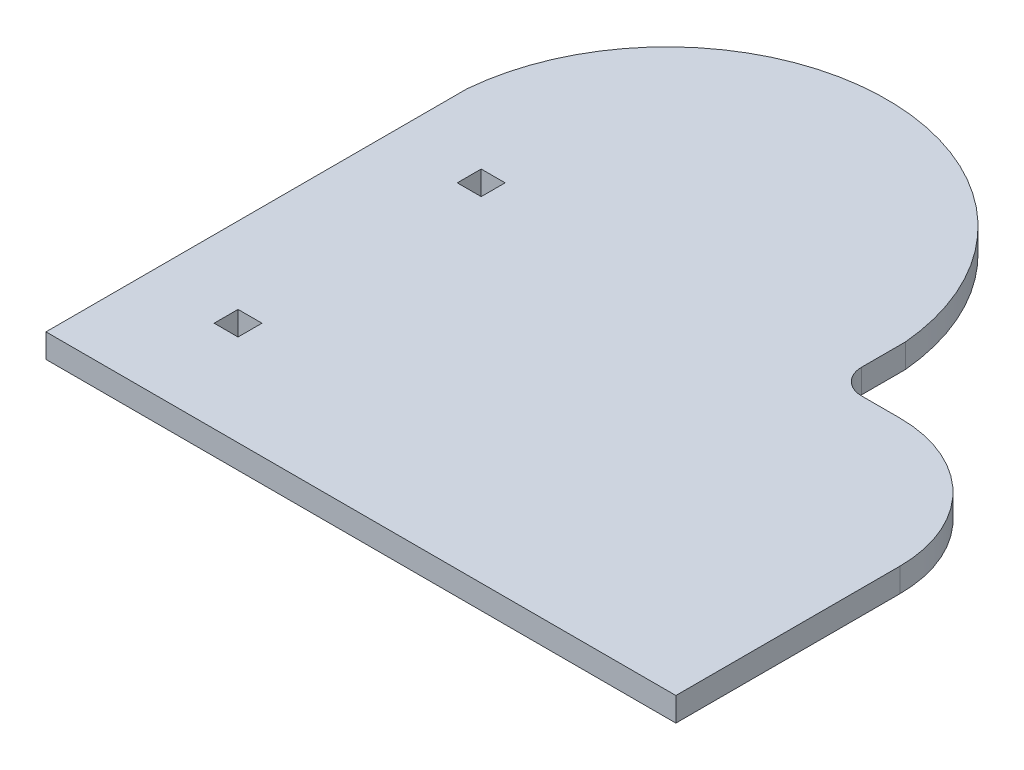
ISO-10303-21;
HEADER;
FILE_DESCRIPTION(('STEP AP214'),'2;1');
FILE_NAME('part.step','',(''),(''),'','','');
FILE_SCHEMA(('AUTOMOTIVE_DESIGN { 1 0 10303 214 1 1 1 1 }'));
ENDSEC;
DATA;
#1=APPLICATION_CONTEXT('core data for automotive mechanical design processes');
#2=APPLICATION_PROTOCOL_DEFINITION('international standard','automotive_design',2000,#1);
#3=PRODUCT_CONTEXT('',#1,'mechanical');
#4=PRODUCT('Part','Part','',(#3));
#5=PRODUCT_RELATED_PRODUCT_CATEGORY('part','',(#4));
#6=PRODUCT_DEFINITION_FORMATION('','',#4);
#7=PRODUCT_DEFINITION_CONTEXT('part definition',#1,'design');
#8=PRODUCT_DEFINITION('design','',#6,#7);
#9=PRODUCT_DEFINITION_SHAPE('','',#8);
#10=(LENGTH_UNIT() NAMED_UNIT(*) SI_UNIT(.MILLI.,.METRE.));
#11=(NAMED_UNIT(*) PLANE_ANGLE_UNIT() SI_UNIT($,.RADIAN.));
#12=(NAMED_UNIT(*) SI_UNIT($,.STERADIAN.) SOLID_ANGLE_UNIT());
#13=UNCERTAINTY_MEASURE_WITH_UNIT(LENGTH_MEASURE(1.E-05),#10,'distance_accuracy_value','');
#14=(GEOMETRIC_REPRESENTATION_CONTEXT(3) GLOBAL_UNCERTAINTY_ASSIGNED_CONTEXT((#13)) GLOBAL_UNIT_ASSIGNED_CONTEXT((#10,
#11,#12)) REPRESENTATION_CONTEXT('',''));
#15=CARTESIAN_POINT('',(0.,0.,0.));
#16=DIRECTION('',(0.,0.,1.));
#17=DIRECTION('',(1.,0.,0.));
#18=AXIS2_PLACEMENT_3D('',#15,#16,#17);
#19=CARTESIAN_POINT('',(6.85799999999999,3.175,0.));
#20=DIRECTION('',(1.,0.,0.));
#21=DIRECTION('',(0.,0.,-1.));
#22=AXIS2_PLACEMENT_3D('',#19,#20,#21);
#23=PLANE('',#22);
#24=DIRECTION('',(0.,0.,1.));
#25=VECTOR('',#24,1.);
#26=CARTESIAN_POINT('',(6.85799999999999,0.,0.));
#27=LINE('',#26,#25);
#28=CARTESIAN_POINT('',(6.858,0.,10.16));
#29=VERTEX_POINT('',#28);
#30=CARTESIAN_POINT('',(6.858,0.,39.878));
#31=VERTEX_POINT('',#30);
#32=EDGE_CURVE('E226',#29,#31,#27,.T.);
#33=ORIENTED_EDGE('',*,*,#32,.F.);
#34=DIRECTION('',(0.,-1.,0.));
#35=VECTOR('',#34,1.);
#36=CARTESIAN_POINT('',(6.858,3.175,10.16));
#37=LINE('',#36,#35);
#38=CARTESIAN_POINT('',(6.858,3.175,10.16));
#39=VERTEX_POINT('',#38);
#40=EDGE_CURVE('E230',#39,#29,#37,.T.);
#41=ORIENTED_EDGE('',*,*,#40,.F.);
#42=DIRECTION('',(0.,0.,1.));
#43=VECTOR('',#42,1.);
#44=CARTESIAN_POINT('',(6.85799999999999,3.175,0.));
#45=LINE('',#44,#43);
#46=CARTESIAN_POINT('',(6.858,3.175,39.878));
#47=VERTEX_POINT('',#46);
#48=EDGE_CURVE('E218',#39,#47,#45,.T.);
#49=ORIENTED_EDGE('',*,*,#48,.T.);
#50=DIRECTION('',(0.,-1.,0.));
#51=VECTOR('',#50,1.);
#52=CARTESIAN_POINT('',(6.858,3.175,39.878));
#53=LINE('',#52,#51);
#54=EDGE_CURVE('E42',#47,#31,#53,.T.);
#55=ORIENTED_EDGE('',*,*,#54,.T.);
#56=EDGE_LOOP('',(#33,#41,#49,#55));
#57=FACE_BOUND('',#56,.T.);
#58=ADVANCED_FACE('F33',(#57),#23,.T.);
#59=CARTESIAN_POINT('',(-76.708,3.175,0.));
#60=DIRECTION('',(1.,0.,0.));
#61=DIRECTION('',(0.,0.,-1.));
#62=AXIS2_PLACEMENT_3D('',#59,#60,#61);
#63=PLANE('',#62);
#64=DIRECTION('',(0.,0.,1.));
#65=VECTOR('',#64,1.);
#66=CARTESIAN_POINT('',(-76.708,0.,0.));
#67=LINE('',#66,#65);
#68=CARTESIAN_POINT('',(-76.708,0.,-15.9537511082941));
#69=VERTEX_POINT('',#68);
#70=CARTESIAN_POINT('',(-76.708,0.,39.878));
#71=VERTEX_POINT('',#70);
#72=EDGE_CURVE('E229',#69,#71,#67,.T.);
#73=ORIENTED_EDGE('',*,*,#72,.T.);
#74=DIRECTION('',(0.,-1.,0.));
#75=VECTOR('',#74,1.);
#76=CARTESIAN_POINT('',(-76.708,3.175,39.878));
#77=LINE('',#76,#75);
#78=CARTESIAN_POINT('',(-76.708,3.175,39.878));
#79=VERTEX_POINT('',#78);
#80=EDGE_CURVE('E11',#79,#71,#77,.T.);
#81=ORIENTED_EDGE('',*,*,#80,.F.);
#82=DIRECTION('',(0.,0.,1.));
#83=VECTOR('',#82,1.);
#84=CARTESIAN_POINT('',(-76.708,3.175,0.));
#85=LINE('',#84,#83);
#86=CARTESIAN_POINT('',(-76.708,3.175,-15.9537511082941));
#87=VERTEX_POINT('',#86);
#88=EDGE_CURVE('E221',#87,#79,#85,.T.);
#89=ORIENTED_EDGE('',*,*,#88,.F.);
#90=DIRECTION('',(0.,-1.,0.));
#91=VECTOR('',#90,1.);
#92=CARTESIAN_POINT('',(-76.708,3.175,-15.9537511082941));
#93=LINE('',#92,#91);
#94=EDGE_CURVE('E37',#87,#69,#93,.T.);
#95=ORIENTED_EDGE('',*,*,#94,.T.);
#96=EDGE_LOOP('',(#73,#81,#89,#95));
#97=FACE_BOUND('',#96,.T.);
#98=ADVANCED_FACE('F275',(#97),#63,.F.);
#99=CARTESIAN_POINT('',(0.,3.175,39.878));
#100=DIRECTION('',(0.,0.,-1.));
#101=DIRECTION('',(-1.,0.,0.));
#102=AXIS2_PLACEMENT_3D('',#99,#100,#101);
#103=PLANE('',#102);
#104=DIRECTION('',(1.,0.,0.));
#105=VECTOR('',#104,1.);
#106=CARTESIAN_POINT('',(0.,0.,39.878));
#107=LINE('',#106,#105);
#108=EDGE_CURVE('E222',#71,#31,#107,.T.);
#109=ORIENTED_EDGE('',*,*,#108,.T.);
#110=ORIENTED_EDGE('',*,*,#54,.F.);
#111=DIRECTION('',(1.,0.,0.));
#112=VECTOR('',#111,1.);
#113=CARTESIAN_POINT('',(0.,3.175,39.878));
#114=LINE('',#113,#112);
#115=EDGE_CURVE('E224',#79,#47,#114,.T.);
#116=ORIENTED_EDGE('',*,*,#115,.F.);
#117=ORIENTED_EDGE('',*,*,#80,.T.);
#118=EDGE_LOOP('',(#109,#110,#116,#117));
#119=FACE_BOUND('',#118,.T.);
#120=ADVANCED_FACE('F302',(#119),#103,.F.);
#121=CARTESIAN_POINT('',(0.,3.175,0.));
#122=DIRECTION('',(0.,1.,0.));
#123=DIRECTION('',(0.,0.,1.));
#124=AXIS2_PLACEMENT_3D('',#121,#122,#123);
#125=PLANE('',#124);
#126=DIRECTION('',(0.,0.,1.));
#127=VECTOR('',#126,1.);
#128=CARTESIAN_POINT('',(-66.548,3.175,-7.69875110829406));
#129=LINE('',#128,#127);
#130=CARTESIAN_POINT('',(-66.548,3.175,-7.69875110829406));
#131=VERTEX_POINT('',#130);
#132=CARTESIAN_POINT('',(-66.548,3.175,-4.52375110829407));
#133=VERTEX_POINT('',#132);
#134=EDGE_CURVE('E50',#131,#133,#129,.T.);
#135=ORIENTED_EDGE('',*,*,#134,.F.);
#136=DIRECTION('',(-1.,0.,0.));
#137=VECTOR('',#136,1.);
#138=CARTESIAN_POINT('',(-66.548,3.175,-7.69875110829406));
#139=LINE('',#138,#137);
#140=CARTESIAN_POINT('',(-63.373,3.175,-7.69875110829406));
#141=VERTEX_POINT('',#140);
#142=EDGE_CURVE('E169',#141,#131,#139,.T.);
#143=ORIENTED_EDGE('',*,*,#142,.F.);
#144=DIRECTION('',(0.,0.,-1.));
#145=VECTOR('',#144,1.);
#146=CARTESIAN_POINT('',(-63.373,3.175,-7.69875110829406));
#147=LINE('',#146,#145);
#148=CARTESIAN_POINT('',(-63.373,3.175,-4.52375110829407));
#149=VERTEX_POINT('',#148);
#150=EDGE_CURVE('E172',#149,#141,#147,.T.);
#151=ORIENTED_EDGE('',*,*,#150,.F.);
#152=DIRECTION('',(1.,0.,0.));
#153=VECTOR('',#152,1.);
#154=CARTESIAN_POINT('',(-66.548,3.175,-4.52375110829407));
#155=LINE('',#154,#153);
#156=EDGE_CURVE('E178',#133,#149,#155,.T.);
#157=ORIENTED_EDGE('',*,*,#156,.F.);
#158=EDGE_LOOP('',(#135,#143,#151,#157));
#159=FACE_BOUND('',#158,.T.);
#160=DIRECTION('',(0.,0.,1.));
#161=VECTOR('',#160,1.);
#162=CARTESIAN_POINT('',(-66.548,3.175,24.5592488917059));
#163=LINE('',#162,#161);
#164=CARTESIAN_POINT('',(-66.548,3.175,24.5592488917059));
#165=VERTEX_POINT('',#164);
#166=CARTESIAN_POINT('',(-66.548,3.175,27.7342488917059));
#167=VERTEX_POINT('',#166);
#168=EDGE_CURVE('E58',#165,#167,#163,.T.);
#169=ORIENTED_EDGE('',*,*,#168,.F.);
#170=DIRECTION('',(-1.,0.,0.));
#171=VECTOR('',#170,1.);
#172=CARTESIAN_POINT('',(-66.548,3.175,24.5592488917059));
#173=LINE('',#172,#171);
#174=CARTESIAN_POINT('',(-63.373,3.175,24.5592488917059));
#175=VERTEX_POINT('',#174);
#176=EDGE_CURVE('E193',#175,#165,#173,.T.);
#177=ORIENTED_EDGE('',*,*,#176,.F.);
#178=DIRECTION('',(0.,0.,-1.));
#179=VECTOR('',#178,1.);
#180=CARTESIAN_POINT('',(-63.373,3.175,24.5592488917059));
#181=LINE('',#180,#179);
#182=CARTESIAN_POINT('',(-63.373,3.175,27.7342488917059));
#183=VERTEX_POINT('',#182);
#184=EDGE_CURVE('E207',#183,#175,#181,.T.);
#185=ORIENTED_EDGE('',*,*,#184,.F.);
#186=DIRECTION('',(1.,0.,0.));
#187=VECTOR('',#186,1.);
#188=CARTESIAN_POINT('',(-66.548,3.175,27.7342488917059));
#189=LINE('',#188,#187);
#190=EDGE_CURVE('E204',#167,#183,#189,.T.);
#191=ORIENTED_EDGE('',*,*,#190,.F.);
#192=EDGE_LOOP('',(#169,#177,#185,#191));
#193=FACE_BOUND('',#192,.T.);
#194=ORIENTED_EDGE('',*,*,#48,.F.);
#195=CARTESIAN_POINT('',(-10.16,3.175,10.16));
#196=DIRECTION('',(0.,1.,0.));
#197=DIRECTION('',(0.,0.,1.));
#198=AXIS2_PLACEMENT_3D('',#195,#196,#197);
#199=CIRCLE('',#198,17.018);
#200=CARTESIAN_POINT('',(-10.16,3.175,-6.858));
#201=VERTEX_POINT('',#200);
#202=EDGE_CURVE('E246',#39,#201,#199,.T.);
#203=ORIENTED_EDGE('',*,*,#202,.T.);
#204=DIRECTION('',(-1.,0.,0.));
#205=VECTOR('',#204,1.);
#206=CARTESIAN_POINT('',(-10.16,3.175,-6.858));
#207=LINE('',#206,#205);
#208=CARTESIAN_POINT('',(-15.24,3.175,-6.858));
#209=VERTEX_POINT('',#208);
#210=EDGE_CURVE('E244',#201,#209,#207,.T.);
#211=ORIENTED_EDGE('',*,*,#210,.T.);
#212=CARTESIAN_POINT('',(-15.24,3.175,-10.16));
#213=DIRECTION('',(0.,-1.,0.));
#214=DIRECTION('',(0.,0.,-1.));
#215=AXIS2_PLACEMENT_3D('',#212,#213,#214);
#216=CIRCLE('',#215,3.302);
#217=CARTESIAN_POINT('',(-18.542,3.175,-10.16));
#218=VERTEX_POINT('',#217);
#219=EDGE_CURVE('E242',#209,#218,#216,.T.);
#220=ORIENTED_EDGE('',*,*,#219,.T.);
#221=DIRECTION('',(0.,0.,1.));
#222=VECTOR('',#221,1.);
#223=CARTESIAN_POINT('',(-18.5419999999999,3.175,-15.9537511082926));
#224=LINE('',#223,#222);
#225=CARTESIAN_POINT('',(-18.5419999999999,3.175,-15.9537511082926));
#226=VERTEX_POINT('',#225);
#227=EDGE_CURVE('E238',#226,#218,#224,.T.);
#228=ORIENTED_EDGE('',*,*,#227,.F.);
#229=CARTESIAN_POINT('',(-47.625,3.175,-13.4125578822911));
#230=DIRECTION('',(0.,1.,0.));
#231=DIRECTION('',(0.,0.,1.));
#232=AXIS2_PLACEMENT_3D('',#229,#230,#231);
#233=CIRCLE('',#232,29.1938101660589);
#234=EDGE_CURVE('E235',#226,#87,#233,.T.);
#235=ORIENTED_EDGE('',*,*,#234,.T.);
#236=ORIENTED_EDGE('',*,*,#88,.T.);
#237=ORIENTED_EDGE('',*,*,#115,.T.);
#238=EDGE_LOOP('',(#194,#203,#211,#220,#228,#235,#236,#237));
#239=FACE_BOUND('',#238,.T.);
#240=ADVANCED_FACE('F305',(#159,#193,#239),#125,.T.);
#241=CARTESIAN_POINT('',(0.,0.,0.));
#242=DIRECTION('',(0.,1.,0.));
#243=DIRECTION('',(0.,0.,1.));
#244=AXIS2_PLACEMENT_3D('',#241,#242,#243);
#245=PLANE('',#244);
#246=DIRECTION('',(-1.,0.,0.));
#247=VECTOR('',#246,1.);
#248=CARTESIAN_POINT('',(-66.548,0.,-7.69875110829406));
#249=LINE('',#248,#247);
#250=CARTESIAN_POINT('',(-63.373,0.,-7.69875110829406));
#251=VERTEX_POINT('',#250);
#252=CARTESIAN_POINT('',(-66.548,0.,-7.69875110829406));
#253=VERTEX_POINT('',#252);
#254=EDGE_CURVE('E156',#251,#253,#249,.T.);
#255=ORIENTED_EDGE('',*,*,#254,.T.);
#256=DIRECTION('',(0.,0.,1.));
#257=VECTOR('',#256,1.);
#258=CARTESIAN_POINT('',(-66.548,0.,-7.69875110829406));
#259=LINE('',#258,#257);
#260=CARTESIAN_POINT('',(-66.548,0.,-4.52375110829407));
#261=VERTEX_POINT('',#260);
#262=EDGE_CURVE('E150',#253,#261,#259,.T.);
#263=ORIENTED_EDGE('',*,*,#262,.T.);
#264=DIRECTION('',(1.,0.,0.));
#265=VECTOR('',#264,1.);
#266=CARTESIAN_POINT('',(-66.548,0.,-4.52375110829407));
#267=LINE('',#266,#265);
#268=CARTESIAN_POINT('',(-63.373,0.,-4.52375110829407));
#269=VERTEX_POINT('',#268);
#270=EDGE_CURVE('E160',#261,#269,#267,.T.);
#271=ORIENTED_EDGE('',*,*,#270,.T.);
#272=DIRECTION('',(0.,0.,-1.));
#273=VECTOR('',#272,1.);
#274=CARTESIAN_POINT('',(-63.373,0.,-7.69875110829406));
#275=LINE('',#274,#273);
#276=EDGE_CURVE('E164',#269,#251,#275,.T.);
#277=ORIENTED_EDGE('',*,*,#276,.T.);
#278=EDGE_LOOP('',(#255,#263,#271,#277));
#279=FACE_BOUND('',#278,.T.);
#280=DIRECTION('',(-1.,0.,0.));
#281=VECTOR('',#280,1.);
#282=CARTESIAN_POINT('',(-66.548,0.,24.5592488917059));
#283=LINE('',#282,#281);
#284=CARTESIAN_POINT('',(-63.373,0.,24.5592488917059));
#285=VERTEX_POINT('',#284);
#286=CARTESIAN_POINT('',(-66.548,0.,24.5592488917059));
#287=VERTEX_POINT('',#286);
#288=EDGE_CURVE('E199',#285,#287,#283,.T.);
#289=ORIENTED_EDGE('',*,*,#288,.T.);
#290=DIRECTION('',(0.,0.,1.));
#291=VECTOR('',#290,1.);
#292=CARTESIAN_POINT('',(-66.548,0.,24.5592488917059));
#293=LINE('',#292,#291);
#294=CARTESIAN_POINT('',(-66.548,0.,27.7342488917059));
#295=VERTEX_POINT('',#294);
#296=EDGE_CURVE('E189',#287,#295,#293,.T.);
#297=ORIENTED_EDGE('',*,*,#296,.T.);
#298=DIRECTION('',(1.,0.,0.));
#299=VECTOR('',#298,1.);
#300=CARTESIAN_POINT('',(-66.548,0.,27.7342488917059));
#301=LINE('',#300,#299);
#302=CARTESIAN_POINT('',(-63.373,0.,27.7342488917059));
#303=VERTEX_POINT('',#302);
#304=EDGE_CURVE('E192',#295,#303,#301,.T.);
#305=ORIENTED_EDGE('',*,*,#304,.T.);
#306=DIRECTION('',(0.,0.,-1.));
#307=VECTOR('',#306,1.);
#308=CARTESIAN_POINT('',(-63.373,0.,24.5592488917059));
#309=LINE('',#308,#307);
#310=EDGE_CURVE('E196',#303,#285,#309,.T.);
#311=ORIENTED_EDGE('',*,*,#310,.T.);
#312=EDGE_LOOP('',(#289,#297,#305,#311));
#313=FACE_BOUND('',#312,.T.);
#314=ORIENTED_EDGE('',*,*,#32,.T.);
#315=ORIENTED_EDGE('',*,*,#108,.F.);
#316=ORIENTED_EDGE('',*,*,#72,.F.);
#317=CARTESIAN_POINT('',(-47.625,0.,-13.4125578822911));
#318=DIRECTION('',(0.,1.,0.));
#319=DIRECTION('',(0.,0.,1.));
#320=AXIS2_PLACEMENT_3D('',#317,#318,#319);
#321=CIRCLE('',#320,29.1938101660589);
#322=CARTESIAN_POINT('',(-18.5419999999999,0.,-15.9537511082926));
#323=VERTEX_POINT('',#322);
#324=EDGE_CURVE('E185',#323,#69,#321,.T.);
#325=ORIENTED_EDGE('',*,*,#324,.F.);
#326=DIRECTION('',(0.,0.,1.));
#327=VECTOR('',#326,1.);
#328=CARTESIAN_POINT('',(-18.5419999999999,0.,-15.9537511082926));
#329=LINE('',#328,#327);
#330=CARTESIAN_POINT('',(-18.542,0.,-10.16));
#331=VERTEX_POINT('',#330);
#332=EDGE_CURVE('E250',#323,#331,#329,.T.);
#333=ORIENTED_EDGE('',*,*,#332,.T.);
#334=CARTESIAN_POINT('',(-15.24,0.,-10.16));
#335=DIRECTION('',(0.,-1.,0.));
#336=DIRECTION('',(0.,0.,-1.));
#337=AXIS2_PLACEMENT_3D('',#334,#335,#336);
#338=CIRCLE('',#337,3.302);
#339=CARTESIAN_POINT('',(-15.24,0.,-6.858));
#340=VERTEX_POINT('',#339);
#341=EDGE_CURVE('E253',#340,#331,#338,.T.);
#342=ORIENTED_EDGE('',*,*,#341,.F.);
#343=DIRECTION('',(-1.,0.,0.));
#344=VECTOR('',#343,1.);
#345=CARTESIAN_POINT('',(-10.16,0.,-6.858));
#346=LINE('',#345,#344);
#347=CARTESIAN_POINT('',(-10.16,0.,-6.858));
#348=VERTEX_POINT('',#347);
#349=EDGE_CURVE('E256',#348,#340,#346,.T.);
#350=ORIENTED_EDGE('',*,*,#349,.F.);
#351=CARTESIAN_POINT('',(-10.16,0.,10.16));
#352=DIRECTION('',(0.,1.,0.));
#353=DIRECTION('',(0.,0.,1.));
#354=AXIS2_PLACEMENT_3D('',#351,#352,#353);
#355=CIRCLE('',#354,17.018);
#356=EDGE_CURVE('E239',#29,#348,#355,.T.);
#357=ORIENTED_EDGE('',*,*,#356,.F.);
#358=EDGE_LOOP('',(#314,#315,#316,#325,#333,#342,#350,#357));
#359=FACE_BOUND('',#358,.T.);
#360=ADVANCED_FACE('F166',(#279,#313,#359),#245,.F.);
#361=CARTESIAN_POINT('',(-47.625,3.175,-13.4125578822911));
#362=DIRECTION('',(0.,-1.,0.));
#363=DIRECTION('',(0.,0.,-1.));
#364=AXIS2_PLACEMENT_3D('',#361,#362,#363);
#365=CYLINDRICAL_SURFACE('',#364,29.1938101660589);
#366=ORIENTED_EDGE('',*,*,#324,.T.);
#367=ORIENTED_EDGE('',*,*,#94,.F.);
#368=ORIENTED_EDGE('',*,*,#234,.F.);
#369=DIRECTION('',(0.,-1.,0.));
#370=VECTOR('',#369,1.);
#371=CARTESIAN_POINT('',(-18.5419999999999,3.175,-15.9537511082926));
#372=LINE('',#371,#370);
#373=EDGE_CURVE('E268',#226,#323,#372,.T.);
#374=ORIENTED_EDGE('',*,*,#373,.T.);
#375=EDGE_LOOP('',(#366,#367,#368,#374));
#376=FACE_BOUND('',#375,.T.);
#377=ADVANCED_FACE('F35',(#376),#365,.T.);
#378=CARTESIAN_POINT('',(-18.5419999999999,3.175,-15.9537511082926));
#379=DIRECTION('',(1.,0.,0.));
#380=DIRECTION('',(0.,0.,-1.));
#381=AXIS2_PLACEMENT_3D('',#378,#379,#380);
#382=PLANE('',#381);
#383=ORIENTED_EDGE('',*,*,#332,.F.);
#384=ORIENTED_EDGE('',*,*,#373,.F.);
#385=ORIENTED_EDGE('',*,*,#227,.T.);
#386=DIRECTION('',(0.,-1.,0.));
#387=VECTOR('',#386,1.);
#388=CARTESIAN_POINT('',(-18.542,3.175,-10.16));
#389=LINE('',#388,#387);
#390=EDGE_CURVE('E267',#218,#331,#389,.T.);
#391=ORIENTED_EDGE('',*,*,#390,.T.);
#392=EDGE_LOOP('',(#383,#384,#385,#391));
#393=FACE_BOUND('',#392,.T.);
#394=ADVANCED_FACE('F282',(#393),#382,.T.);
#395=CARTESIAN_POINT('',(-15.24,3.175,-10.16));
#396=DIRECTION('',(0.,-1.,0.));
#397=DIRECTION('',(0.,0.,-1.));
#398=AXIS2_PLACEMENT_3D('',#395,#396,#397);
#399=CYLINDRICAL_SURFACE('',#398,3.302);
#400=ORIENTED_EDGE('',*,*,#341,.T.);
#401=ORIENTED_EDGE('',*,*,#390,.F.);
#402=ORIENTED_EDGE('',*,*,#219,.F.);
#403=DIRECTION('',(0.,-1.,0.));
#404=VECTOR('',#403,1.);
#405=CARTESIAN_POINT('',(-15.24,3.175,-6.858));
#406=LINE('',#405,#404);
#407=EDGE_CURVE('E264',#209,#340,#406,.T.);
#408=ORIENTED_EDGE('',*,*,#407,.T.);
#409=EDGE_LOOP('',(#400,#401,#402,#408));
#410=FACE_BOUND('',#409,.T.);
#411=ADVANCED_FACE('F287',(#410),#399,.F.);
#412=CARTESIAN_POINT('',(-10.16,3.175,-6.858));
#413=DIRECTION('',(0.,0.,1.));
#414=DIRECTION('',(1.,0.,0.));
#415=AXIS2_PLACEMENT_3D('',#412,#413,#414);
#416=PLANE('',#415);
#417=ORIENTED_EDGE('',*,*,#349,.T.);
#418=ORIENTED_EDGE('',*,*,#407,.F.);
#419=ORIENTED_EDGE('',*,*,#210,.F.);
#420=DIRECTION('',(0.,-1.,0.));
#421=VECTOR('',#420,1.);
#422=CARTESIAN_POINT('',(-10.16,3.175,-6.858));
#423=LINE('',#422,#421);
#424=EDGE_CURVE('E261',#201,#348,#423,.T.);
#425=ORIENTED_EDGE('',*,*,#424,.T.);
#426=EDGE_LOOP('',(#417,#418,#419,#425));
#427=FACE_BOUND('',#426,.T.);
#428=ADVANCED_FACE('F292',(#427),#416,.F.);
#429=CARTESIAN_POINT('',(-10.16,3.175,10.16));
#430=DIRECTION('',(0.,-1.,0.));
#431=DIRECTION('',(0.,0.,-1.));
#432=AXIS2_PLACEMENT_3D('',#429,#430,#431);
#433=CYLINDRICAL_SURFACE('',#432,17.018);
#434=ORIENTED_EDGE('',*,*,#356,.T.);
#435=ORIENTED_EDGE('',*,*,#424,.F.);
#436=ORIENTED_EDGE('',*,*,#202,.F.);
#437=ORIENTED_EDGE('',*,*,#40,.T.);
#438=EDGE_LOOP('',(#434,#435,#436,#437));
#439=FACE_BOUND('',#438,.T.);
#440=ADVANCED_FACE('F297',(#439),#433,.T.);
#441=CARTESIAN_POINT('',(-66.548,0.,24.5592488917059));
#442=DIRECTION('',(-1.,0.,0.));
#443=DIRECTION('',(0.,0.,1.));
#444=AXIS2_PLACEMENT_3D('',#441,#442,#443);
#445=PLANE('',#444);
#446=ORIENTED_EDGE('',*,*,#168,.T.);
#447=DIRECTION('',(0.,1.,0.));
#448=VECTOR('',#447,1.);
#449=CARTESIAN_POINT('',(-66.548,0.,27.7342488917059));
#450=LINE('',#449,#448);
#451=EDGE_CURVE('E202',#295,#167,#450,.T.);
#452=ORIENTED_EDGE('',*,*,#451,.F.);
#453=ORIENTED_EDGE('',*,*,#296,.F.);
#454=DIRECTION('',(0.,1.,0.));
#455=VECTOR('',#454,1.);
#456=CARTESIAN_POINT('',(-66.548,0.,24.5592488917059));
#457=LINE('',#456,#455);
#458=EDGE_CURVE('E179',#287,#165,#457,.T.);
#459=ORIENTED_EDGE('',*,*,#458,.T.);
#460=EDGE_LOOP('',(#446,#452,#453,#459));
#461=FACE_BOUND('',#460,.T.);
#462=ADVANCED_FACE('F314',(#461),#445,.F.);
#463=CARTESIAN_POINT('',(-66.548,0.,24.5592488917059));
#464=DIRECTION('',(0.,0.,-1.));
#465=DIRECTION('',(-1.,0.,0.));
#466=AXIS2_PLACEMENT_3D('',#463,#464,#465);
#467=PLANE('',#466);
#468=ORIENTED_EDGE('',*,*,#176,.T.);
#469=ORIENTED_EDGE('',*,*,#458,.F.);
#470=ORIENTED_EDGE('',*,*,#288,.F.);
#471=DIRECTION('',(0.,1.,0.));
#472=VECTOR('',#471,1.);
#473=CARTESIAN_POINT('',(-63.373,0.,24.5592488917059));
#474=LINE('',#473,#472);
#475=EDGE_CURVE('E213',#285,#175,#474,.T.);
#476=ORIENTED_EDGE('',*,*,#475,.T.);
#477=EDGE_LOOP('',(#468,#469,#470,#476));
#478=FACE_BOUND('',#477,.T.);
#479=ADVANCED_FACE('F324',(#478),#467,.F.);
#480=CARTESIAN_POINT('',(-63.373,0.,24.5592488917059));
#481=DIRECTION('',(1.,0.,0.));
#482=DIRECTION('',(0.,0.,-1.));
#483=AXIS2_PLACEMENT_3D('',#480,#481,#482);
#484=PLANE('',#483);
#485=ORIENTED_EDGE('',*,*,#184,.T.);
#486=ORIENTED_EDGE('',*,*,#475,.F.);
#487=ORIENTED_EDGE('',*,*,#310,.F.);
#488=DIRECTION('',(0.,1.,0.));
#489=VECTOR('',#488,1.);
#490=CARTESIAN_POINT('',(-63.373,0.,27.7342488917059));
#491=LINE('',#490,#489);
#492=EDGE_CURVE('E215',#303,#183,#491,.T.);
#493=ORIENTED_EDGE('',*,*,#492,.T.);
#494=EDGE_LOOP('',(#485,#486,#487,#493));
#495=FACE_BOUND('',#494,.T.);
#496=ADVANCED_FACE('F371',(#495),#484,.F.);
#497=CARTESIAN_POINT('',(-66.548,0.,27.7342488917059));
#498=DIRECTION('',(0.,0.,1.));
#499=DIRECTION('',(1.,0.,0.));
#500=AXIS2_PLACEMENT_3D('',#497,#498,#499);
#501=PLANE('',#500);
#502=ORIENTED_EDGE('',*,*,#190,.T.);
#503=ORIENTED_EDGE('',*,*,#492,.F.);
#504=ORIENTED_EDGE('',*,*,#304,.F.);
#505=ORIENTED_EDGE('',*,*,#451,.T.);
#506=EDGE_LOOP('',(#502,#503,#504,#505));
#507=FACE_BOUND('',#506,.T.);
#508=ADVANCED_FACE('F381',(#507),#501,.F.);
#509=CARTESIAN_POINT('',(-66.548,0.,-7.69875110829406));
#510=DIRECTION('',(-1.,0.,0.));
#511=DIRECTION('',(0.,0.,1.));
#512=AXIS2_PLACEMENT_3D('',#509,#510,#511);
#513=PLANE('',#512);
#514=ORIENTED_EDGE('',*,*,#134,.T.);
#515=DIRECTION('',(0.,1.,0.));
#516=VECTOR('',#515,1.);
#517=CARTESIAN_POINT('',(-66.548,0.,-4.52375110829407));
#518=LINE('',#517,#516);
#519=EDGE_CURVE('E146',#261,#133,#518,.T.);
#520=ORIENTED_EDGE('',*,*,#519,.F.);
#521=ORIENTED_EDGE('',*,*,#262,.F.);
#522=DIRECTION('',(0.,1.,0.));
#523=VECTOR('',#522,1.);
#524=CARTESIAN_POINT('',(-66.548,0.,-7.69875110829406));
#525=LINE('',#524,#523);
#526=EDGE_CURVE('E183',#253,#131,#525,.T.);
#527=ORIENTED_EDGE('',*,*,#526,.T.);
#528=EDGE_LOOP('',(#514,#520,#521,#527));
#529=FACE_BOUND('',#528,.T.);
#530=ADVANCED_FACE('F148',(#529),#513,.F.);
#531=CARTESIAN_POINT('',(-66.548,0.,-7.69875110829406));
#532=DIRECTION('',(0.,0.,-1.));
#533=DIRECTION('',(-1.,0.,0.));
#534=AXIS2_PLACEMENT_3D('',#531,#532,#533);
#535=PLANE('',#534);
#536=ORIENTED_EDGE('',*,*,#142,.T.);
#537=ORIENTED_EDGE('',*,*,#526,.F.);
#538=ORIENTED_EDGE('',*,*,#254,.F.);
#539=DIRECTION('',(0.,1.,0.));
#540=VECTOR('',#539,1.);
#541=CARTESIAN_POINT('',(-63.373,0.,-7.69875110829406));
#542=LINE('',#541,#540);
#543=EDGE_CURVE('E186',#251,#141,#542,.T.);
#544=ORIENTED_EDGE('',*,*,#543,.T.);
#545=EDGE_LOOP('',(#536,#537,#538,#544));
#546=FACE_BOUND('',#545,.T.);
#547=ADVANCED_FACE('F400',(#546),#535,.F.);
#548=CARTESIAN_POINT('',(-63.373,0.,-7.69875110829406));
#549=DIRECTION('',(1.,0.,0.));
#550=DIRECTION('',(0.,0.,-1.));
#551=AXIS2_PLACEMENT_3D('',#548,#549,#550);
#552=PLANE('',#551);
#553=ORIENTED_EDGE('',*,*,#150,.T.);
#554=ORIENTED_EDGE('',*,*,#543,.F.);
#555=ORIENTED_EDGE('',*,*,#276,.F.);
#556=DIRECTION('',(0.,1.,0.));
#557=VECTOR('',#556,1.);
#558=CARTESIAN_POINT('',(-63.373,0.,-4.52375110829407));
#559=LINE('',#558,#557);
#560=EDGE_CURVE('E155',#269,#149,#559,.T.);
#561=ORIENTED_EDGE('',*,*,#560,.T.);
#562=EDGE_LOOP('',(#553,#554,#555,#561));
#563=FACE_BOUND('',#562,.T.);
#564=ADVANCED_FACE('F409',(#563),#552,.F.);
#565=CARTESIAN_POINT('',(-66.548,0.,-4.52375110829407));
#566=DIRECTION('',(0.,0.,1.));
#567=DIRECTION('',(1.,0.,0.));
#568=AXIS2_PLACEMENT_3D('',#565,#566,#567);
#569=PLANE('',#568);
#570=ORIENTED_EDGE('',*,*,#156,.T.);
#571=ORIENTED_EDGE('',*,*,#560,.F.);
#572=ORIENTED_EDGE('',*,*,#270,.F.);
#573=ORIENTED_EDGE('',*,*,#519,.T.);
#574=EDGE_LOOP('',(#570,#571,#572,#573));
#575=FACE_BOUND('',#574,.T.);
#576=ADVANCED_FACE('F161',(#575),#569,.F.);
#577=CLOSED_SHELL('',(#58,#98,#120,#240,#360,#377,#394,#411,#428,#440,#462,#479,#496,#508,#530,
#547,#564,#576));
#578=MANIFOLD_SOLID_BREP('B2',#577);
#579=ADVANCED_BREP_SHAPE_REPRESENTATION('',(#18,#578),#14);
#580=SHAPE_DEFINITION_REPRESENTATION(#9,#579);
ENDSEC;
END-ISO-10303-21;
